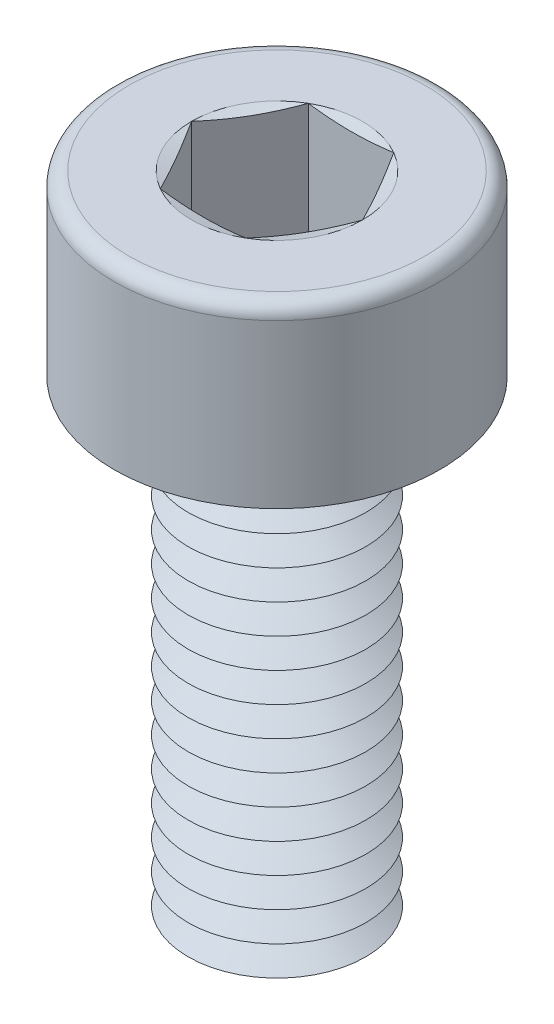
from build123d import *

# Parameters (mm, degrees)
SKETCH1_R       = 1.5
EXTRUDE1_DEPTH  = 8
SKETCH2_R       = 2.75
EXTRUDE2_DEPTH  = 3
EXTRUDE3_DEPTH  = 2.5
FILLET1_R       = 0.25
LPATTERN1_COUNT = 16
LPATTERN1_PITCH = 0.5


with BuildPart() as part:
    # Sketch1 → Extrude1 (new body)
    with BuildSketch(Plane(origin=(0, 0, 0), x_dir=(1, 0, 0), z_dir=(0, 1, 0))):
        with Locations(Location((0, 0, 0), (0, 0, 270))):
            Circle(SKETCH1_R)
    extrude(amount=EXTRUDE1_DEPTH)

    # Sketch2 → Extrude2 (add)
    with BuildSketch(Plane(origin=(0, 8, 0), x_dir=(1, 0, 0), z_dir=(0, 1, 0))):
        with Locations(Location((0, 0, 0), (0, 0, 270))):
            Circle(SKETCH2_R)
    extrude(amount=EXTRUDE2_DEPTH)

    # Sketch3 → Extrude3 (cut)
    with BuildSketch(Plane(origin=(0, 11, 0), x_dir=(1, 0, 0), z_dir=(0, 1, 0))):
        Polygon((0.721687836, 1.25), (-0.721687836, 1.25), (-1.443375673, 0), (-0.721687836, -1.25), (0.721687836, -1.25), (1.443375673, 0), align=None)
    extrude(amount=-EXTRUDE3_DEPTH, mode=Mode.SUBTRACT)

    # Fillet1
    fillet1_edges = [part.edges().sort_by_distance(p)[0] for p in [
        (0, 11, -2.75),
    ]]
    fillet(fillet1_edges, radius=FILLET1_R)

    # Sketch4 → Cut-Revolve1 (revolve, cut)
    with BuildSketch(Plane(origin=(0, 0, 0), x_dir=(0, 0, -1), z_dir=(1, 0, 0))):
        Polygon((-1.25, 8.5), (0, 8.5), (0, 7.778312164), align=None)
    revolve(axis=Axis((0, 8.5, 0), (0, -1, 0)), mode=Mode.SUBTRACT)

    # Sketch5 → Cut-Revolve2 (revolve, cut)
    with BuildSketch(Plane.XY, mode=Mode.PRIVATE) as cut_revolve2_sk:
        Polygon((-1.5, 0.25), (-1.5, -0.25), (-1.066987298, 0), align=None)
    cut_revolve2 = revolve(cut_revolve2_sk.sketch.rotate(Axis((0, 8, 0), (0, -1, 0)), 270), axis=Axis((0, 8, 0), (0, -1, 0)), mode=Mode.SUBTRACT)

    # LPattern1: Cut-Revolve2 ×16
    with Locations(*[(0, i * LPATTERN1_PITCH, 0) for i in range(1, LPATTERN1_COUNT)]):
        add(cut_revolve2, mode=Mode.SUBTRACT)

    # Extrude4 cone 1 section (on through the dimple's axis) → Extrude4 (revolve, cut)
    with BuildSketch(Plane(origin=(0, 11, 0), x_dir=(0, 0, 1), z_dir=(1, 0, 0))):
        Polygon((0, 0), (1.443375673, 0), (0, 0.386751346), align=None)
    revolve(axis=Axis((0, 11, 0), (0, -1, 0)), mode=Mode.SUBTRACT)


solid = part.part
